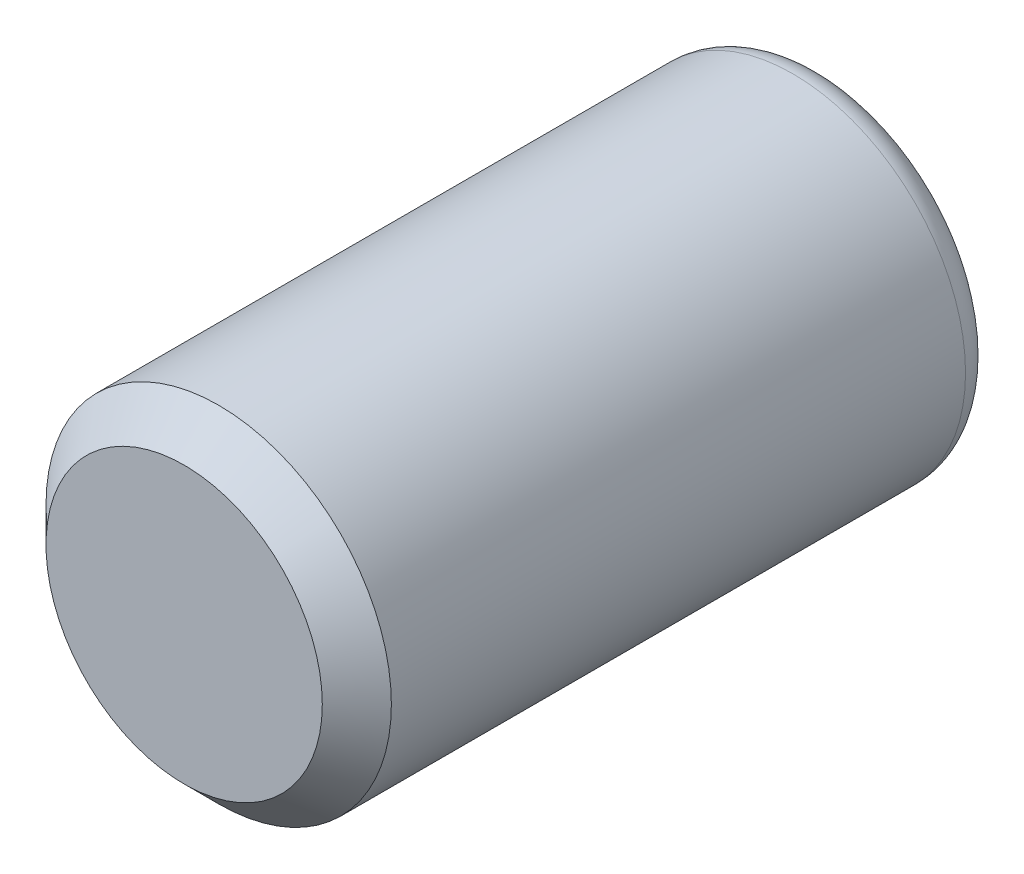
from build123d import *

# Parameters (mm, degrees)
ENLEV_MAT_EXTRU1_DEPTH = 3
ESQUISSE3_W            = 4
ESQUISSE3_H            = 7.8
CHANFREIN1_SIZE        = 0.8


with BuildPart() as part:
    # Esquisse1 → Base-R_volution (revolve)
    with BuildSketch(Plane(origin=(0, 0, 0), x_dir=(1, 0, 0), z_dir=(0, 1, 0)), mode=Mode.PRIVATE) as base_r_volution_sk:
        with BuildLine():
            Line((0, 0), (4, 0))
            Line((4, 0), (4, 6.3))
            ThreePointArc((4, 6.3), (3.794974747, 6.794974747), (3.3, 7))
            Line((3.3, 7), (0, 7))
            Line((0, 7), (0, 0))
        make_face()
    revolve(base_r_volution_sk.sketch.rotate(Axis((0, 0, 0), (0, 0, -1)), 180), axis=Axis((0, 0, 0), (0, 0, -1)))

    # Esquisse2 → enlev-mat-Extru1 (cut)
    with BuildSketch(Plane.XY.offset(-7)):
        Polygon((2, -1.154700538), (2, 1.154700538), (0, 2.309401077), (-2, 1.154700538), (-2, -1.154700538), (0, -2.309401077), align=None)
    extrude(amount=ENLEV_MAT_EXTRU1_DEPTH, mode=Mode.SUBTRACT)

    # Esquisse3 → Boss.-R_vol.1 (revolve)
    with BuildSketch(Plane(origin=(0, 0, 0), x_dir=(1, 0, 0), z_dir=(0, 1, 0)), mode=Mode.PRIVATE) as boss_r_vol_1_sk:
        with Locations((2, -3.9)):
            Rectangle(ESQUISSE3_W, ESQUISSE3_H)
    revolve(boss_r_vol_1_sk.sketch.rotate(Axis((0, 0, 0), (0, 0, 1)), 180), axis=Axis((0, 0, 0), (0, 0, 1)))

    # Chanfrein1
    chanfrein1_edges = [part.edges().sort_by_distance(p)[0] for p in [
        (4, 0, 7.8),
    ]]
    chamfer(chanfrein1_edges, length=CHANFREIN1_SIZE)


solid = part.part
